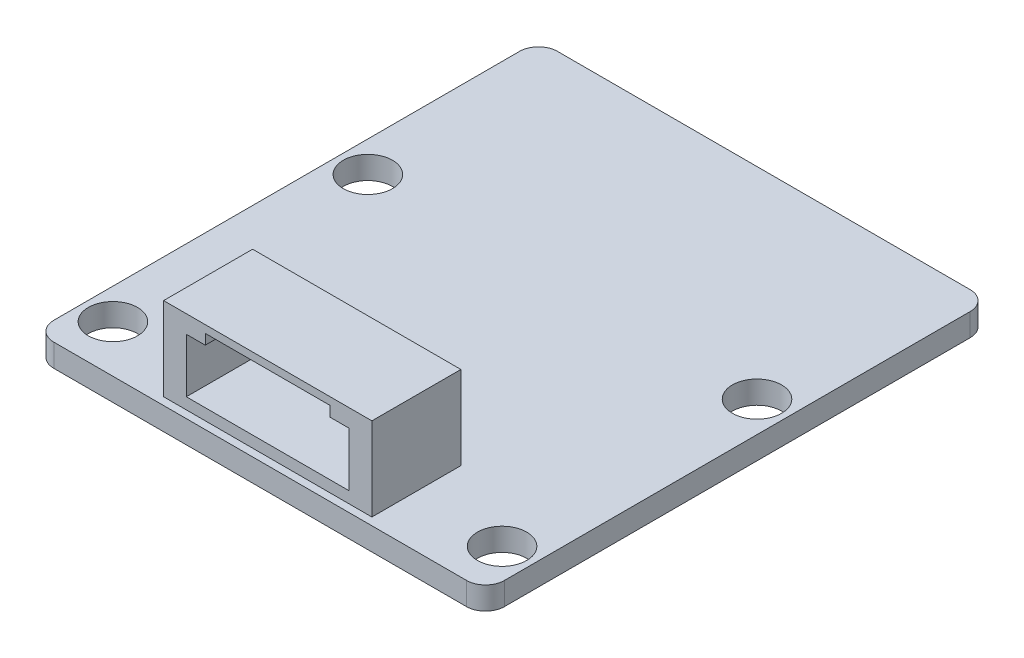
from build123d import *

# Parameters (mm, degrees)
SKETCH1_W            = 15.113
SKETCH1_H            = 33.782
BOSS_EXTRUDE1_DEPTH  = 1.524
FILLET1_R            = 1.27
SKETCH2_R            = 1.651
CUT_EXTRUDE1_DEPTH   = 23.716320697
SKETCH3_W            = 6.985
SKETCH3_H            = 5.969
BOSS_EXTRUDE2_DEPTH  = 5.588
CUT_EXTRUDE2_DEPTH   = 5.08
FILLET1_OF_MIRROR1_R = 1.27


with BuildPart() as part:
    # Sketch1 → Boss-Extrude1 (new body)
    with BuildSketch(Plane(origin=(0, 0, 0), x_dir=(1, 0, 0), z_dir=(0, 1, 0))):
        with Locations((-7.5565, 0)):
            Rectangle(SKETCH1_W, SKETCH1_H)
    boss_extrude1 = extrude(amount=BOSS_EXTRUDE1_DEPTH)

    # Fillet1
    fillet1_edges = [part.edges().sort_by_distance(p)[0] for p in [
        (-15.113, 0.762, 16.891),
        (-15.113, 0.762, -16.891),
    ]]
    fillet(fillet1_edges, radius=FILLET1_R)

    # Sketch2 → Cut-Extrude1 (cut, through all)
    with BuildSketch(Plane(origin=(0, 1.524, 0), x_dir=(1, 0, 0), z_dir=(0, 1, 0))):
        with Locations(Location((-13.05052, -13.716, 0), (0, 0, 270))):
            Circle(SKETCH2_R)
        with Locations(Location((-13.05052, 3.38328, 0), (0, 0, 270))):
            Circle(SKETCH2_R)
    cut_extrude1 = extrude(amount=-CUT_EXTRUDE1_DEPTH, mode=Mode.SUBTRACT)

    # Sketch3 → Boss-Extrude2 (add)
    with BuildSketch(Plane(origin=(0, 1.524, 0), x_dir=(1, 0, 0), z_dir=(0, 1, 0))):
        with Locations((-3.4925, -13.3985)):
            Rectangle(SKETCH3_W, SKETCH3_H)
    boss_extrude2 = extrude(amount=BOSS_EXTRUDE2_DEPTH)

    # Sketch4 → Cut-Extrude2 (cut)
    with BuildSketch(Plane.XY.offset(16.383)):
        Polygon((-4.191, 5.9182), (-5.461, 5.9182), (-5.461, 2.286), (0, 2.286), (0, 5.9182), (0, 6.604), (-4.191, 6.604), align=None)
    cut_extrude2 = extrude(amount=-CUT_EXTRUDE2_DEPTH, mode=Mode.SUBTRACT)

    # Mirror1: Boss-Extrude1, Cut-Extrude1, Boss-Extrude2, Cut-Extrude2 across plane
    add(boss_extrude1.mirror(Plane(origin=(0, 1.524, -16.891), x_dir=(0, 0, 1), z_dir=(-1, 0, 0))))
    add(cut_extrude1.mirror(Plane(origin=(0, 1.524, -16.891), x_dir=(0, 0, 1), z_dir=(-1, 0, 0))), mode=Mode.SUBTRACT)
    add(boss_extrude2.mirror(Plane(origin=(0, 1.524, -16.891), x_dir=(0, 0, 1), z_dir=(-1, 0, 0))))
    add(cut_extrude2.mirror(Plane(origin=(0, 1.524, -16.891), x_dir=(0, 0, 1), z_dir=(-1, 0, 0))), mode=Mode.SUBTRACT)

    # Fillet1 of Mirror1
    fillet1_of_mirror1_edges = [part.edges().sort_by_distance(p)[0] for p in [
        (15.113, 0.762, 16.891),
        (15.113, 0.762, -16.891),
    ]]
    fillet(fillet1_of_mirror1_edges, radius=FILLET1_OF_MIRROR1_R)


solid = part.part
